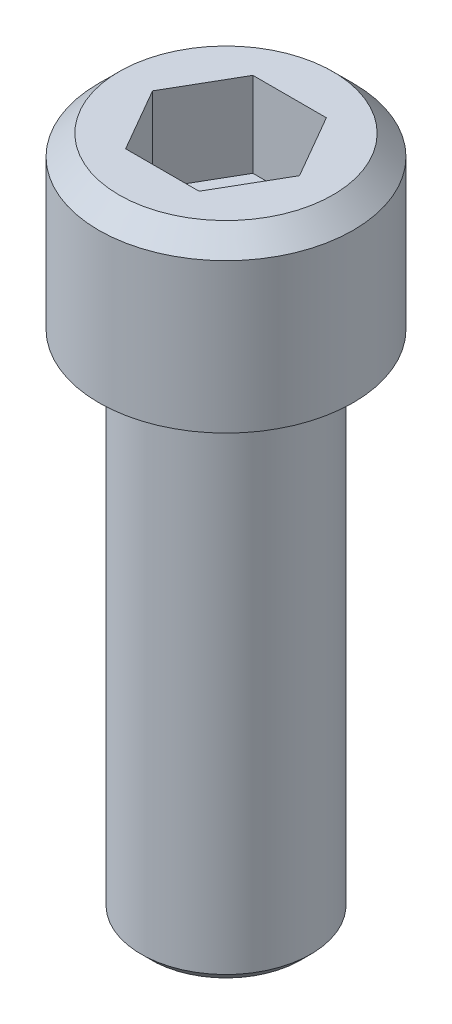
from build123d import *

# Parameters (mm, degrees)
CUT_EXTRUDE1_DEPTH = 6.35
CHAMFER1_SIZE      = 1.524
CHAMFER2_SIZE      = 0.762


with BuildPart() as part:
    # Sketch1 → Base-Revolve (revolve)
    with BuildSketch(Plane.XY, mode=Mode.PRIVATE) as base_revolve_sk:
        Polygon((6.35, 0), (9.525, 0), (9.525, 12.7), (0, 12.7), (0, -38.1), (6.35, -38.1), align=None)
    revolve(base_revolve_sk.sketch.rotate(Axis((0, 0, 0), (0, 1, 0)), 90), axis=Axis((0, 0, 0), (0, 1, 0)))

    # Sketch2 → Cut-Extrude1 (cut)
    with BuildSketch(Plane(origin=(0, 12.7, 0), x_dir=(-1, 0, 0), z_dir=(0, 1, 0))):
        Polygon((2.749630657, -4.7625), (-2.749630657, -4.7625), (-5.499261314, 0), (-2.749630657, 4.7625), (2.749630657, 4.7625), (5.499261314, 0), align=None)
    extrude(amount=-CUT_EXTRUDE1_DEPTH, mode=Mode.SUBTRACT)

    # Chamfer1
    chamfer1_edges = [part.edges().sort_by_distance(p)[0] for p in [
        (0, 12.7, 9.525),
    ]]
    chamfer(chamfer1_edges, length=CHAMFER1_SIZE)

    # Chamfer2
    chamfer2_edges = [part.edges().sort_by_distance(p)[0] for p in [
        (0, -38.1, 6.35),
    ]]
    chamfer(chamfer2_edges, length=CHAMFER2_SIZE)


solid = part.part
